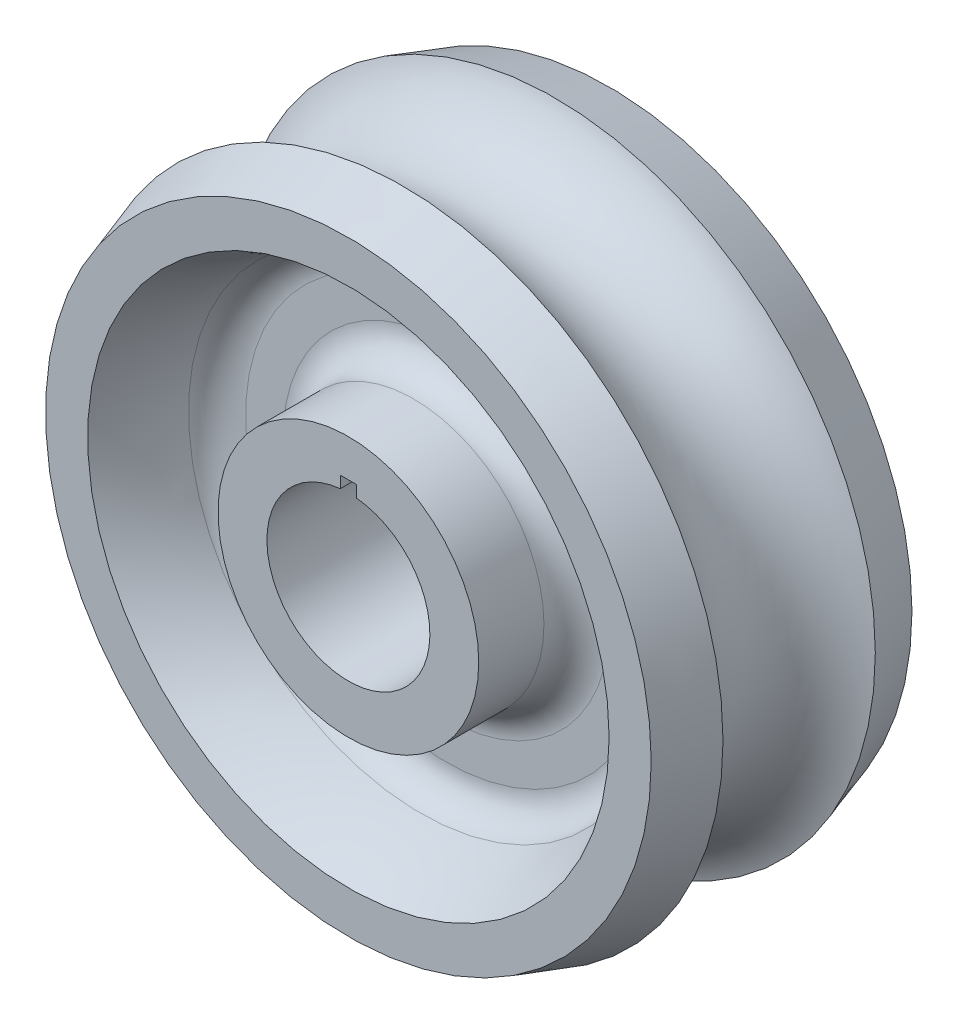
ISO-10303-21;
HEADER;
FILE_DESCRIPTION(('STEP AP214'),'2;1');
FILE_NAME('part.step','',(''),(''),'','','');
FILE_SCHEMA(('AUTOMOTIVE_DESIGN { 1 0 10303 214 1 1 1 1 }'));
ENDSEC;
DATA;
#1=APPLICATION_CONTEXT('core data for automotive mechanical design processes');
#2=APPLICATION_PROTOCOL_DEFINITION('international standard','automotive_design',2000,#1);
#3=PRODUCT_CONTEXT('',#1,'mechanical');
#4=PRODUCT('Part','Part','',(#3));
#5=PRODUCT_RELATED_PRODUCT_CATEGORY('part','',(#4));
#6=PRODUCT_DEFINITION_FORMATION('','',#4);
#7=PRODUCT_DEFINITION_CONTEXT('part definition',#1,'design');
#8=PRODUCT_DEFINITION('design','',#6,#7);
#9=PRODUCT_DEFINITION_SHAPE('','',#8);
#10=(LENGTH_UNIT() NAMED_UNIT(*) SI_UNIT(.MILLI.,.METRE.));
#11=(NAMED_UNIT(*) PLANE_ANGLE_UNIT() SI_UNIT($,.RADIAN.));
#12=(NAMED_UNIT(*) SI_UNIT($,.STERADIAN.) SOLID_ANGLE_UNIT());
#13=UNCERTAINTY_MEASURE_WITH_UNIT(LENGTH_MEASURE(1.E-05),#10,'distance_accuracy_value','');
#14=(GEOMETRIC_REPRESENTATION_CONTEXT(3) GLOBAL_UNCERTAINTY_ASSIGNED_CONTEXT((#13)) GLOBAL_UNIT_ASSIGNED_CONTEXT((#10,
#11,#12)) REPRESENTATION_CONTEXT('',''));
#15=CARTESIAN_POINT('',(0.,0.,0.));
#16=DIRECTION('',(0.,0.,1.));
#17=DIRECTION('',(1.,0.,0.));
#18=AXIS2_PLACEMENT_3D('',#15,#16,#17);
#19=CARTESIAN_POINT('',(0.,7.9375,-12.7));
#20=DIRECTION('',(0.,0.,1.));
#21=DIRECTION('',(1.,0.,0.));
#22=AXIS2_PLACEMENT_3D('',#19,#20,#21);
#23=PLANE('',#22);
#24=CARTESIAN_POINT('',(0.,0.,-12.7));
#25=DIRECTION('',(0.,0.,1.));
#26=DIRECTION('',(1.,0.,0.));
#27=AXIS2_PLACEMENT_3D('',#24,#25,#26);
#28=CIRCLE('',#27,12.7);
#29=CARTESIAN_POINT('',(12.7,0.,-12.7));
#30=VERTEX_POINT('',#29);
#31=EDGE_CURVE('E106',#30,#30,#28,.T.);
#32=ORIENTED_EDGE('',*,*,#31,.F.);
#33=EDGE_LOOP('',(#32));
#34=FACE_BOUND('',#33,.T.);
#35=DIRECTION('',(0.,1.,0.));
#36=VECTOR('',#35,1.);
#37=CARTESIAN_POINT('',(-0.793749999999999,7.8977127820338,-12.7));
#38=LINE('',#37,#36);
#39=CARTESIAN_POINT('',(-0.793749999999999,7.8977127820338,-12.7));
#40=VERTEX_POINT('',#39);
#41=CARTESIAN_POINT('',(-0.79375,9.0424,-12.7));
#42=VERTEX_POINT('',#41);
#43=EDGE_CURVE('E79',#40,#42,#38,.T.);
#44=ORIENTED_EDGE('',*,*,#43,.F.);
#45=CARTESIAN_POINT('',(0.,0.,-12.7));
#46=DIRECTION('',(0.,0.,1.));
#47=DIRECTION('',(1.,0.,0.));
#48=AXIS2_PLACEMENT_3D('',#45,#46,#47);
#49=CIRCLE('',#48,7.9375);
#50=CARTESIAN_POINT('',(0.793749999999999,7.8977127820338,-12.7));
#51=VERTEX_POINT('',#50);
#52=EDGE_CURVE('E11',#40,#51,#49,.T.);
#53=ORIENTED_EDGE('',*,*,#52,.T.);
#54=DIRECTION('',(0.,1.,0.));
#55=VECTOR('',#54,1.);
#56=CARTESIAN_POINT('',(0.793749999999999,7.8977127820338,-12.7));
#57=LINE('',#56,#55);
#58=CARTESIAN_POINT('',(0.79375,9.0424,-12.7));
#59=VERTEX_POINT('',#58);
#60=EDGE_CURVE('E55',#51,#59,#57,.T.);
#61=ORIENTED_EDGE('',*,*,#60,.T.);
#62=DIRECTION('',(1.,0.,0.));
#63=VECTOR('',#62,1.);
#64=CARTESIAN_POINT('',(-0.79375,9.0424,-12.7));
#65=LINE('',#64,#63);
#66=EDGE_CURVE('E86',#42,#59,#65,.T.);
#67=ORIENTED_EDGE('',*,*,#66,.F.);
#68=EDGE_LOOP('',(#44,#53,#61,#67));
#69=FACE_BOUND('',#68,.T.);
#70=ADVANCED_FACE('F34',(#34,#69),#23,.F.);
#71=CARTESIAN_POINT('',(0.,0.,0.));
#72=DIRECTION('',(0.,0.,1.));
#73=DIRECTION('',(1.,0.,0.));
#74=AXIS2_PLACEMENT_3D('',#71,#72,#73);
#75=CYLINDRICAL_SURFACE('',#74,7.9375);
#76=DIRECTION('',(0.,0.,1.));
#77=VECTOR('',#76,1.);
#78=CARTESIAN_POINT('',(-0.793749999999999,7.8977127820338,-12.7));
#79=LINE('',#78,#77);
#80=CARTESIAN_POINT('',(-0.793749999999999,7.8977127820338,12.7));
#81=VERTEX_POINT('',#80);
#82=EDGE_CURVE('E77',#40,#81,#79,.T.);
#83=ORIENTED_EDGE('',*,*,#82,.T.);
#84=CARTESIAN_POINT('',(0.,0.,12.7));
#85=DIRECTION('',(0.,0.,1.));
#86=DIRECTION('',(1.,0.,0.));
#87=AXIS2_PLACEMENT_3D('',#84,#85,#86);
#88=CIRCLE('',#87,7.9375);
#89=CARTESIAN_POINT('',(0.793749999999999,7.8977127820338,12.7));
#90=VERTEX_POINT('',#89);
#91=EDGE_CURVE('E42',#81,#90,#88,.T.);
#92=ORIENTED_EDGE('',*,*,#91,.T.);
#93=DIRECTION('',(0.,0.,1.));
#94=VECTOR('',#93,1.);
#95=CARTESIAN_POINT('',(0.793749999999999,7.8977127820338,-12.7));
#96=LINE('',#95,#94);
#97=EDGE_CURVE('E49',#51,#90,#96,.T.);
#98=ORIENTED_EDGE('',*,*,#97,.F.);
#99=ORIENTED_EDGE('',*,*,#52,.F.);
#100=EDGE_LOOP('',(#83,#92,#98,#99));
#101=FACE_BOUND('',#100,.T.);
#102=ADVANCED_FACE('F158',(#101),#75,.F.);
#103=CARTESIAN_POINT('',(0.,7.9375,12.7));
#104=DIRECTION('',(0.,0.,1.));
#105=DIRECTION('',(1.,0.,0.));
#106=AXIS2_PLACEMENT_3D('',#103,#104,#105);
#107=PLANE('',#106);
#108=CARTESIAN_POINT('',(0.,0.,12.7));
#109=DIRECTION('',(0.,0.,1.));
#110=DIRECTION('',(1.,0.,0.));
#111=AXIS2_PLACEMENT_3D('',#108,#109,#110);
#112=CIRCLE('',#111,12.7);
#113=CARTESIAN_POINT('',(12.7,0.,12.7));
#114=VERTEX_POINT('',#113);
#115=EDGE_CURVE('E151',#114,#114,#112,.T.);
#116=ORIENTED_EDGE('',*,*,#115,.T.);
#117=EDGE_LOOP('',(#116));
#118=FACE_BOUND('',#117,.T.);
#119=ORIENTED_EDGE('',*,*,#91,.F.);
#120=DIRECTION('',(0.,1.,0.));
#121=VECTOR('',#120,1.);
#122=CARTESIAN_POINT('',(-0.793749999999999,7.8977127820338,12.7));
#123=LINE('',#122,#121);
#124=CARTESIAN_POINT('',(-0.79375,9.0424,12.7));
#125=VERTEX_POINT('',#124);
#126=EDGE_CURVE('E98',#81,#125,#123,.T.);
#127=ORIENTED_EDGE('',*,*,#126,.T.);
#128=DIRECTION('',(1.,0.,0.));
#129=VECTOR('',#128,1.);
#130=CARTESIAN_POINT('',(-0.79375,9.0424,12.7));
#131=LINE('',#130,#129);
#132=CARTESIAN_POINT('',(0.79375,9.0424,12.7));
#133=VERTEX_POINT('',#132);
#134=EDGE_CURVE('E91',#125,#133,#131,.T.);
#135=ORIENTED_EDGE('',*,*,#134,.T.);
#136=DIRECTION('',(0.,1.,0.));
#137=VECTOR('',#136,1.);
#138=CARTESIAN_POINT('',(0.793749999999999,7.8977127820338,12.7));
#139=LINE('',#138,#137);
#140=EDGE_CURVE('E87',#90,#133,#139,.T.);
#141=ORIENTED_EDGE('',*,*,#140,.F.);
#142=EDGE_LOOP('',(#119,#127,#135,#141));
#143=FACE_BOUND('',#142,.T.);
#144=ADVANCED_FACE('F160',(#118,#143),#107,.T.);
#145=CARTESIAN_POINT('',(0.,0.,0.));
#146=DIRECTION('',(0.,0.,1.));
#147=DIRECTION('',(1.,0.,0.));
#148=AXIS2_PLACEMENT_3D('',#145,#146,#147);
#149=CYLINDRICAL_SURFACE('',#148,12.7);
#150=CARTESIAN_POINT('',(0.,0.,6.35));
#151=DIRECTION('',(0.,0.,1.));
#152=DIRECTION('',(1.,0.,0.));
#153=AXIS2_PLACEMENT_3D('',#150,#151,#152);
#154=CIRCLE('',#153,12.7);
#155=CARTESIAN_POINT('',(12.7,0.,6.35));
#156=VERTEX_POINT('',#155);
#157=EDGE_CURVE('E148',#156,#156,#154,.T.);
#158=ORIENTED_EDGE('',*,*,#157,.T.);
#159=EDGE_LOOP('',(#158));
#160=FACE_BOUND('',#159,.T.);
#161=ORIENTED_EDGE('',*,*,#115,.F.);
#162=EDGE_LOOP('',(#161));
#163=FACE_BOUND('',#162,.T.);
#164=ADVANCED_FACE('F236',(#160,#163),#149,.T.);
#165=CARTESIAN_POINT('',(0.,0.,6.35));
#166=DIRECTION('',(0.,0.,1.));
#167=DIRECTION('',(1.,0.,0.));
#168=AXIS2_PLACEMENT_3D('',#165,#166,#167);
#169=TOROIDAL_SURFACE('',#168,15.875,3.175);
#170=CARTESIAN_POINT('',(0.,0.,3.175));
#171=DIRECTION('',(0.,0.,1.));
#172=DIRECTION('',(1.,0.,0.));
#173=AXIS2_PLACEMENT_3D('',#170,#171,#172);
#174=CIRCLE('',#173,15.875);
#175=CARTESIAN_POINT('',(15.875,0.,3.175));
#176=VERTEX_POINT('',#175);
#177=EDGE_CURVE('E145',#176,#176,#174,.T.);
#178=ORIENTED_EDGE('',*,*,#177,.T.);
#179=EDGE_LOOP('',(#178));
#180=FACE_BOUND('',#179,.T.);
#181=ORIENTED_EDGE('',*,*,#157,.F.);
#182=EDGE_LOOP('',(#181));
#183=FACE_BOUND('',#182,.T.);
#184=ADVANCED_FACE('F232',(#180,#183),#169,.F.);
#185=CARTESIAN_POINT('',(0.,15.875,3.175));
#186=DIRECTION('',(0.,0.,1.));
#187=DIRECTION('',(1.,0.,0.));
#188=AXIS2_PLACEMENT_3D('',#185,#186,#187);
#189=PLANE('',#188);
#190=CARTESIAN_POINT('',(0.,0.,3.175));
#191=DIRECTION('',(0.,0.,1.));
#192=DIRECTION('',(1.,0.,0.));
#193=AXIS2_PLACEMENT_3D('',#190,#191,#192);
#194=CIRCLE('',#193,19.5365333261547);
#195=CARTESIAN_POINT('',(19.5365333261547,0.,3.175));
#196=VERTEX_POINT('',#195);
#197=EDGE_CURVE('E142',#196,#196,#194,.T.);
#198=ORIENTED_EDGE('',*,*,#197,.T.);
#199=EDGE_LOOP('',(#198));
#200=FACE_BOUND('',#199,.T.);
#201=ORIENTED_EDGE('',*,*,#177,.F.);
#202=EDGE_LOOP('',(#201));
#203=FACE_BOUND('',#202,.T.);
#204=ADVANCED_FACE('F228',(#200,#203),#189,.T.);
#205=CARTESIAN_POINT('',(0.,0.,6.35));
#206=DIRECTION('',(0.,0.,1.));
#207=DIRECTION('',(1.,0.,0.));
#208=AXIS2_PLACEMENT_3D('',#205,#206,#207);
#209=TOROIDAL_SURFACE('',#208,19.5365333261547,3.175);
#210=CARTESIAN_POINT('',(0.,0.,5.64444444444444));
#211=DIRECTION('',(0.,0.,1.));
#212=DIRECTION('',(1.,0.,0.));
#213=AXIS2_PLACEMENT_3D('',#210,#211,#212);
#214=CIRCLE('',#213,22.6321457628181);
#215=CARTESIAN_POINT('',(22.6321457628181,0.,5.64444444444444));
#216=VERTEX_POINT('',#215);
#217=EDGE_CURVE('E139',#216,#216,#214,.T.);
#218=ORIENTED_EDGE('',*,*,#217,.T.);
#219=EDGE_LOOP('',(#218));
#220=FACE_BOUND('',#219,.T.);
#221=ORIENTED_EDGE('',*,*,#197,.F.);
#222=EDGE_LOOP('',(#221));
#223=FACE_BOUND('',#222,.T.);
#224=ADVANCED_FACE('F224',(#220,#223),#209,.F.);
#225=CARTESIAN_POINT('',(0.,0.,0.));
#226=DIRECTION('',(0.,0.,1.));
#227=DIRECTION('',(1.,0.,0.));
#228=AXIS2_PLACEMENT_3D('',#225,#226,#227);
#229=TOROIDAL_SURFACE('',#228,47.3970452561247,25.4);
#230=CARTESIAN_POINT('',(0.,0.,12.7));
#231=DIRECTION('',(0.,0.,1.));
#232=DIRECTION('',(1.,0.,0.));
#233=AXIS2_PLACEMENT_3D('',#230,#231,#232);
#234=CIRCLE('',#233,25.4);
#235=CARTESIAN_POINT('',(25.4,0.,12.7));
#236=VERTEX_POINT('',#235);
#237=EDGE_CURVE('E136',#236,#236,#234,.T.);
#238=ORIENTED_EDGE('',*,*,#237,.T.);
#239=EDGE_LOOP('',(#238));
#240=FACE_BOUND('',#239,.T.);
#241=ORIENTED_EDGE('',*,*,#217,.F.);
#242=EDGE_LOOP('',(#241));
#243=FACE_BOUND('',#242,.T.);
#244=ADVANCED_FACE('F220',(#240,#243),#229,.T.);
#245=CARTESIAN_POINT('',(0.,25.4,12.7));
#246=DIRECTION('',(0.,0.,1.));
#247=DIRECTION('',(1.,0.,0.));
#248=AXIS2_PLACEMENT_3D('',#245,#246,#247);
#249=PLANE('',#248);
#250=CARTESIAN_POINT('',(0.,0.,12.7));
#251=DIRECTION('',(0.,0.,1.));
#252=DIRECTION('',(1.,0.,0.));
#253=AXIS2_PLACEMENT_3D('',#250,#251,#252);
#254=CIRCLE('',#253,29.5021);
#255=CARTESIAN_POINT('',(29.5021,0.,12.7));
#256=VERTEX_POINT('',#255);
#257=EDGE_CURVE('E133',#256,#256,#254,.T.);
#258=ORIENTED_EDGE('',*,*,#257,.T.);
#259=EDGE_LOOP('',(#258));
#260=FACE_BOUND('',#259,.T.);
#261=ORIENTED_EDGE('',*,*,#237,.F.);
#262=EDGE_LOOP('',(#261));
#263=FACE_BOUND('',#262,.T.);
#264=ADVANCED_FACE('F216',(#260,#263),#249,.T.);
#265=CARTESIAN_POINT('',(0.,0.,12.7));
#266=DIRECTION('',(0.,0.,-1.));
#267=DIRECTION('',(-1.,0.,0.));
#268=AXIS2_PLACEMENT_3D('',#265,#266,#267);
#269=CONICAL_SURFACE('',#268,29.5021,0.313327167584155);
#270=CARTESIAN_POINT('',(0.,0.,7.41815100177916));
#271=DIRECTION('',(0.,0.,1.));
#272=DIRECTION('',(1.,0.,0.));
#273=AXIS2_PLACEMENT_3D('',#270,#271,#272);
#274=CIRCLE('',#273,31.2134190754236);
#275=CARTESIAN_POINT('',(31.2134190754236,0.,7.41815100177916));
#276=VERTEX_POINT('',#275);
#277=EDGE_CURVE('E130',#276,#276,#274,.T.);
#278=ORIENTED_EDGE('',*,*,#277,.T.);
#279=EDGE_LOOP('',(#278));
#280=FACE_BOUND('',#279,.T.);
#281=ORIENTED_EDGE('',*,*,#257,.F.);
#282=EDGE_LOOP('',(#281));
#283=FACE_BOUND('',#282,.T.);
#284=ADVANCED_FACE('F212',(#280,#283),#269,.T.);
#285=CARTESIAN_POINT('',(0.,0.,0.));
#286=DIRECTION('',(0.,0.,1.));
#287=DIRECTION('',(1.,0.,0.));
#288=AXIS2_PLACEMENT_3D('',#285,#286,#287);
#289=TOROIDAL_SURFACE('',#288,33.6169,7.7978);
#290=ORIENTED_EDGE('',*,*,#277,.F.);
#291=EDGE_LOOP('',(#290));
#292=FACE_BOUND('',#291,.T.);
#293=CARTESIAN_POINT('',(0.,0.,-7.41815100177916));
#294=DIRECTION('',(0.,0.,1.));
#295=DIRECTION('',(1.,0.,0.));
#296=AXIS2_PLACEMENT_3D('',#293,#294,#295);
#297=CIRCLE('',#296,31.2134190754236);
#298=CARTESIAN_POINT('',(31.2134190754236,0.,-7.41815100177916));
#299=VERTEX_POINT('',#298);
#300=EDGE_CURVE('E127',#299,#299,#297,.T.);
#301=ORIENTED_EDGE('',*,*,#300,.T.);
#302=EDGE_LOOP('',(#301));
#303=FACE_BOUND('',#302,.T.);
#304=ADVANCED_FACE('F208',(#292,#303),#289,.F.);
#305=CARTESIAN_POINT('',(0.,0.,-12.7));
#306=DIRECTION('',(0.,0.,1.));
#307=DIRECTION('',(1.,0.,0.));
#308=AXIS2_PLACEMENT_3D('',#305,#306,#307);
#309=CONICAL_SURFACE('',#308,29.5021,0.313327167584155);
#310=ORIENTED_EDGE('',*,*,#300,.F.);
#311=EDGE_LOOP('',(#310));
#312=FACE_BOUND('',#311,.T.);
#313=CARTESIAN_POINT('',(0.,0.,-12.7));
#314=DIRECTION('',(0.,0.,1.));
#315=DIRECTION('',(1.,0.,0.));
#316=AXIS2_PLACEMENT_3D('',#313,#314,#315);
#317=CIRCLE('',#316,29.5021);
#318=CARTESIAN_POINT('',(29.5021,0.,-12.7));
#319=VERTEX_POINT('',#318);
#320=EDGE_CURVE('E124',#319,#319,#317,.T.);
#321=ORIENTED_EDGE('',*,*,#320,.T.);
#322=EDGE_LOOP('',(#321));
#323=FACE_BOUND('',#322,.T.);
#324=ADVANCED_FACE('F204',(#312,#323),#309,.T.);
#325=CARTESIAN_POINT('',(0.,25.4,-12.7));
#326=DIRECTION('',(0.,0.,1.));
#327=DIRECTION('',(1.,0.,0.));
#328=AXIS2_PLACEMENT_3D('',#325,#326,#327);
#329=PLANE('',#328);
#330=ORIENTED_EDGE('',*,*,#320,.F.);
#331=EDGE_LOOP('',(#330));
#332=FACE_BOUND('',#331,.T.);
#333=CARTESIAN_POINT('',(0.,0.,-12.7));
#334=DIRECTION('',(0.,0.,1.));
#335=DIRECTION('',(1.,0.,0.));
#336=AXIS2_PLACEMENT_3D('',#333,#334,#335);
#337=CIRCLE('',#336,25.4);
#338=CARTESIAN_POINT('',(25.4,0.,-12.7));
#339=VERTEX_POINT('',#338);
#340=EDGE_CURVE('E121',#339,#339,#337,.T.);
#341=ORIENTED_EDGE('',*,*,#340,.T.);
#342=EDGE_LOOP('',(#341));
#343=FACE_BOUND('',#342,.T.);
#344=ADVANCED_FACE('F200',(#332,#343),#329,.F.);
#345=CARTESIAN_POINT('',(0.,0.,0.));
#346=DIRECTION('',(0.,0.,1.));
#347=DIRECTION('',(1.,0.,0.));
#348=AXIS2_PLACEMENT_3D('',#345,#346,#347);
#349=TOROIDAL_SURFACE('',#348,47.3970452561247,25.4);
#350=ORIENTED_EDGE('',*,*,#340,.F.);
#351=EDGE_LOOP('',(#350));
#352=FACE_BOUND('',#351,.T.);
#353=CARTESIAN_POINT('',(0.,0.,-5.64444444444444));
#354=DIRECTION('',(0.,0.,1.));
#355=DIRECTION('',(1.,0.,0.));
#356=AXIS2_PLACEMENT_3D('',#353,#354,#355);
#357=CIRCLE('',#356,22.6321457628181);
#358=CARTESIAN_POINT('',(22.6321457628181,0.,-5.64444444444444));
#359=VERTEX_POINT('',#358);
#360=EDGE_CURVE('E118',#359,#359,#357,.T.);
#361=ORIENTED_EDGE('',*,*,#360,.T.);
#362=EDGE_LOOP('',(#361));
#363=FACE_BOUND('',#362,.T.);
#364=ADVANCED_FACE('F196',(#352,#363),#349,.T.);
#365=CARTESIAN_POINT('',(0.,0.,-6.35));
#366=DIRECTION('',(0.,0.,1.));
#367=DIRECTION('',(1.,0.,0.));
#368=AXIS2_PLACEMENT_3D('',#365,#366,#367);
#369=TOROIDAL_SURFACE('',#368,19.5365333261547,3.175);
#370=ORIENTED_EDGE('',*,*,#360,.F.);
#371=EDGE_LOOP('',(#370));
#372=FACE_BOUND('',#371,.T.);
#373=CARTESIAN_POINT('',(0.,0.,-3.175));
#374=DIRECTION('',(0.,0.,1.));
#375=DIRECTION('',(1.,0.,0.));
#376=AXIS2_PLACEMENT_3D('',#373,#374,#375);
#377=CIRCLE('',#376,19.5365333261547);
#378=CARTESIAN_POINT('',(19.5365333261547,0.,-3.175));
#379=VERTEX_POINT('',#378);
#380=EDGE_CURVE('E115',#379,#379,#377,.T.);
#381=ORIENTED_EDGE('',*,*,#380,.T.);
#382=EDGE_LOOP('',(#381));
#383=FACE_BOUND('',#382,.T.);
#384=ADVANCED_FACE('F192',(#372,#383),#369,.F.);
#385=CARTESIAN_POINT('',(0.,15.875,-3.175));
#386=DIRECTION('',(0.,0.,1.));
#387=DIRECTION('',(1.,0.,0.));
#388=AXIS2_PLACEMENT_3D('',#385,#386,#387);
#389=PLANE('',#388);
#390=ORIENTED_EDGE('',*,*,#380,.F.);
#391=EDGE_LOOP('',(#390));
#392=FACE_BOUND('',#391,.T.);
#393=CARTESIAN_POINT('',(0.,0.,-3.175));
#394=DIRECTION('',(0.,0.,1.));
#395=DIRECTION('',(1.,0.,0.));
#396=AXIS2_PLACEMENT_3D('',#393,#394,#395);
#397=CIRCLE('',#396,15.875);
#398=CARTESIAN_POINT('',(15.875,0.,-3.175));
#399=VERTEX_POINT('',#398);
#400=EDGE_CURVE('E112',#399,#399,#397,.T.);
#401=ORIENTED_EDGE('',*,*,#400,.T.);
#402=EDGE_LOOP('',(#401));
#403=FACE_BOUND('',#402,.T.);
#404=ADVANCED_FACE('F185',(#392,#403),#389,.F.);
#405=CARTESIAN_POINT('',(0.,0.,-6.35));
#406=DIRECTION('',(0.,0.,1.));
#407=DIRECTION('',(1.,0.,0.));
#408=AXIS2_PLACEMENT_3D('',#405,#406,#407);
#409=TOROIDAL_SURFACE('',#408,15.875,3.175);
#410=ORIENTED_EDGE('',*,*,#400,.F.);
#411=EDGE_LOOP('',(#410));
#412=FACE_BOUND('',#411,.T.);
#413=CARTESIAN_POINT('',(0.,0.,-6.35));
#414=DIRECTION('',(0.,0.,1.));
#415=DIRECTION('',(1.,0.,0.));
#416=AXIS2_PLACEMENT_3D('',#413,#414,#415);
#417=CIRCLE('',#416,12.7);
#418=CARTESIAN_POINT('',(12.7,0.,-6.35));
#419=VERTEX_POINT('',#418);
#420=EDGE_CURVE('E109',#419,#419,#417,.T.);
#421=ORIENTED_EDGE('',*,*,#420,.T.);
#422=EDGE_LOOP('',(#421));
#423=FACE_BOUND('',#422,.T.);
#424=ADVANCED_FACE('F177',(#412,#423),#409,.F.);
#425=CARTESIAN_POINT('',(0.,0.,0.));
#426=DIRECTION('',(0.,0.,1.));
#427=DIRECTION('',(1.,0.,0.));
#428=AXIS2_PLACEMENT_3D('',#425,#426,#427);
#429=CYLINDRICAL_SURFACE('',#428,12.7);
#430=ORIENTED_EDGE('',*,*,#420,.F.);
#431=EDGE_LOOP('',(#430));
#432=FACE_BOUND('',#431,.T.);
#433=ORIENTED_EDGE('',*,*,#31,.T.);
#434=EDGE_LOOP('',(#433));
#435=FACE_BOUND('',#434,.T.);
#436=ADVANCED_FACE('F175',(#432,#435),#429,.T.);
#437=CARTESIAN_POINT('',(-0.793749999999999,7.8977127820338,-12.7));
#438=DIRECTION('',(1.,0.,0.));
#439=DIRECTION('',(0.,1.,0.));
#440=AXIS2_PLACEMENT_3D('',#437,#438,#439);
#441=PLANE('',#440);
#442=ORIENTED_EDGE('',*,*,#126,.F.);
#443=ORIENTED_EDGE('',*,*,#82,.F.);
#444=ORIENTED_EDGE('',*,*,#43,.T.);
#445=DIRECTION('',(0.,0.,1.));
#446=VECTOR('',#445,1.);
#447=CARTESIAN_POINT('',(-0.79375,9.0424,-12.7));
#448=LINE('',#447,#446);
#449=EDGE_CURVE('E82',#42,#125,#448,.T.);
#450=ORIENTED_EDGE('',*,*,#449,.T.);
#451=EDGE_LOOP('',(#442,#443,#444,#450));
#452=FACE_BOUND('',#451,.T.);
#453=ADVANCED_FACE('F81',(#452),#441,.T.);
#454=CARTESIAN_POINT('',(-0.79375,9.0424,-12.7));
#455=DIRECTION('',(0.,-1.,0.));
#456=DIRECTION('',(0.,0.,-1.));
#457=AXIS2_PLACEMENT_3D('',#454,#455,#456);
#458=PLANE('',#457);
#459=ORIENTED_EDGE('',*,*,#134,.F.);
#460=ORIENTED_EDGE('',*,*,#449,.F.);
#461=ORIENTED_EDGE('',*,*,#66,.T.);
#462=DIRECTION('',(0.,0.,1.));
#463=VECTOR('',#462,1.);
#464=CARTESIAN_POINT('',(0.79375,9.0424,-12.7));
#465=LINE('',#464,#463);
#466=EDGE_CURVE('E71',#59,#133,#465,.T.);
#467=ORIENTED_EDGE('',*,*,#466,.T.);
#468=EDGE_LOOP('',(#459,#460,#461,#467));
#469=FACE_BOUND('',#468,.T.);
#470=ADVANCED_FACE('F89',(#469),#458,.T.);
#471=CARTESIAN_POINT('',(0.793749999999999,7.8977127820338,-12.7));
#472=DIRECTION('',(1.,0.,0.));
#473=DIRECTION('',(0.,1.,0.));
#474=AXIS2_PLACEMENT_3D('',#471,#472,#473);
#475=PLANE('',#474);
#476=ORIENTED_EDGE('',*,*,#140,.T.);
#477=ORIENTED_EDGE('',*,*,#466,.F.);
#478=ORIENTED_EDGE('',*,*,#60,.F.);
#479=ORIENTED_EDGE('',*,*,#97,.T.);
#480=EDGE_LOOP('',(#476,#477,#478,#479));
#481=FACE_BOUND('',#480,.T.);
#482=ADVANCED_FACE('F161',(#481),#475,.F.);
#483=CLOSED_SHELL('',(#70,#102,#144,#164,#184,#204,#224,#244,#264,#284,#304,#324,#344,#364,#384,
#404,#424,#436,#453,#470,#482));
#484=MANIFOLD_SOLID_BREP('B2',#483);
#485=ADVANCED_BREP_SHAPE_REPRESENTATION('',(#18,#484),#14);
#486=SHAPE_DEFINITION_REPRESENTATION(#9,#485);
ENDSEC;
END-ISO-10303-21;
